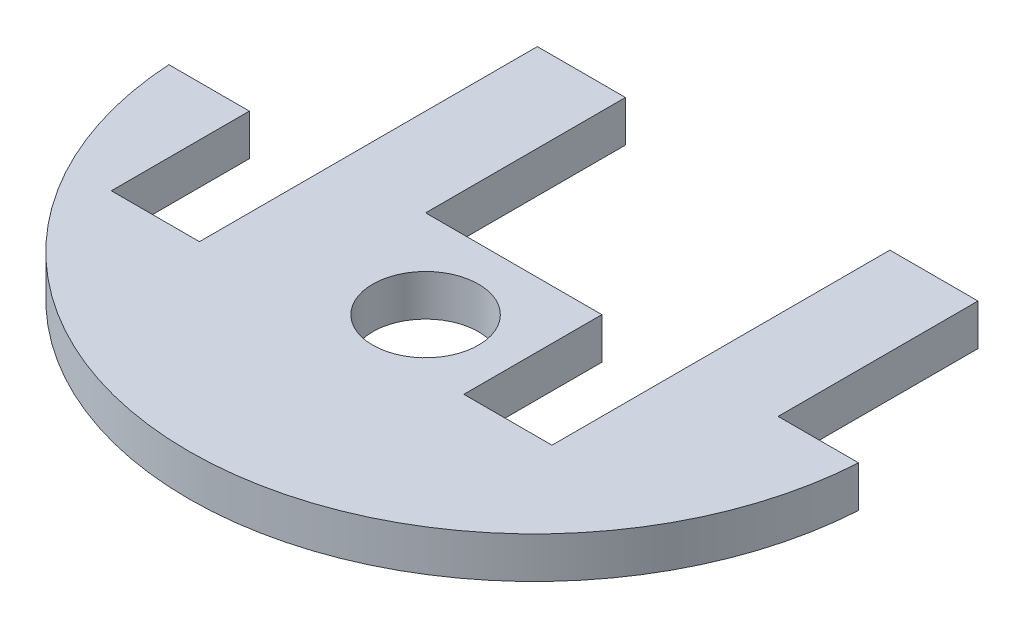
from build123d import *

# Parameters (mm, degrees)
SKETCH1_R           = 24.892
BOSS_EXTRUDE1_DEPTH = 2.9718
CUT_EXTRUDE1_DEPTH  = 36.327820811
SKETCH3_W           = 6.35
SKETCH3_H           = 14.4018
BOSS_EXTRUDE2_DEPTH = 2.9718
SKETCH5_W           = 6.35
SKETCH5_H           = 9.9441
CUT_EXTRUDE2_DEPTH  = 36.296558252
SKETCH6_R           = 3.81
CUT_EXTRUDE3_DEPTH  = 36.296558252


with BuildPart() as part:
    # Sketch1 → Boss-Extrude1 (new body)
    with BuildSketch(Plane(origin=(0, 0, 0), x_dir=(1, 0, 0), z_dir=(0, 1, 0))):
        with Locations(Location((0, 0, 0), (0, 0, 270))):
            Circle(SKETCH1_R)
    extrude(amount=BOSS_EXTRUDE1_DEPTH)

    # Sketch2 → Cut-Extrude1 (cut, through all)
    with BuildSketch(Plane(origin=(0, 2.9718, 0), x_dir=(1, 0, 0), z_dir=(0, 1, 0))):
        Polygon((-27.186913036, 1.4859), (-24.497692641, 26.892203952), (2.65238176, 27.850008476), (25.41865853, 24.571369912), (27.186913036, 1.4859), (27.186913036, -1.4859), (-27.186913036, -1.4859), align=None)
    extrude(amount=-CUT_EXTRUDE1_DEPTH, mode=Mode.SUBTRACT)

    # Sketch3 → Boss-Extrude2 (add)
    with BuildSketch(Plane(origin=(0, 2.9718, 0), x_dir=(1, 0, 0), z_dir=(0, 1, 0))):
        with Locations((15.875, 5.715)):
            Rectangle(SKETCH3_W, SKETCH3_H)
        with Locations((-9.525, 5.715)):
            Rectangle(SKETCH3_W, SKETCH3_H)
    extrude(amount=-BOSS_EXTRUDE2_DEPTH)

    # Sketch5 → Cut-Extrude2 (cut, through all)
    with BuildSketch(Plane(origin=(0, 2.9718, 0), x_dir=(1, 0, 0), z_dir=(0, 1, 0))):
        with Locations((9.525, -6.45795)):
            Rectangle(SKETCH5_W, SKETCH5_H)
        with Locations((-15.875, -6.45795)):
            Rectangle(SKETCH5_W, SKETCH5_H)
    extrude(amount=-CUT_EXTRUDE2_DEPTH, mode=Mode.SUBTRACT)

    # Sketch6 → Cut-Extrude3 (cut, through all)
    with BuildSketch(Plane(origin=(0, 2.9718, 0), x_dir=(1, 0, 0), z_dir=(0, 1, 0))):
        with Locations(Location((0, -7.8359, 0), (0, 0, 270))):
            Circle(SKETCH6_R)
    extrude(amount=-CUT_EXTRUDE3_DEPTH, mode=Mode.SUBTRACT)


solid = part.part
